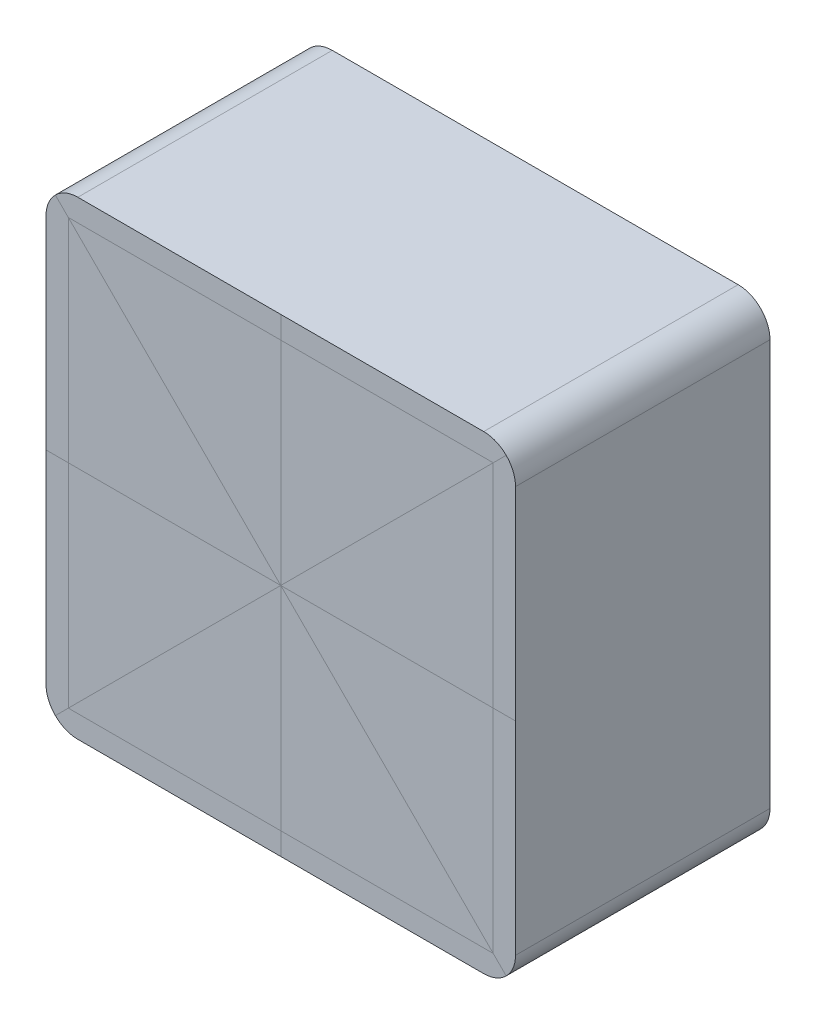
from build123d import *

# Parameters (mm, degrees)
F_18_45M_BASE_BLOCK_DEPTH = 10000


with BuildPart() as part:
    # Sketch1 → 18.45m base block (new body)
    with BuildSketch(Plane(origin=(0, 0, 0), x_dir=(0, 1, 0), z_dir=(0, 0, 1))):
        with BuildLine():
            Line((-7975.599999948, 9225), (7975.599999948, 9225))
            ThreePointArc((7975.599999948, 9225), (8859.059212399, 8859.059212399), (9225, 7975.599999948))
            Line((9225, 7975.599999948), (9225, -7975.599999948))
            ThreePointArc((9225, -7975.599999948), (8859.059212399, -8859.059212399), (7975.599999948, -9225))
            Line((7975.599999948, -9225), (-7975.599999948, -9225))
            ThreePointArc((-7975.599999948, -9225), (-8859.059212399, -8859.059212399), (-9225, -7975.599999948))
            Line((-9225, -7975.599999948), (-9225, 7975.599999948))
            ThreePointArc((-9225, 7975.599999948), (-8859.059212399, 8859.059212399), (-7975.599999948, 9225))
        make_face()
    extrude(amount=F_18_45M_BASE_BLOCK_DEPTH)


solid = part.part
